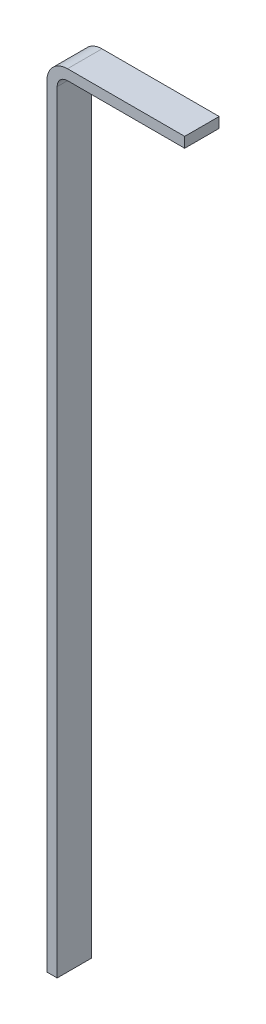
from build123d import *

# Parameters (mm, degrees)
BOSS_EXTRU_1_DEPTH = 20


with BuildPart() as part:
    # Esquisse1 → Boss.-Extru.1 (new body)
    with BuildSketch(Plane.XY):
        with BuildLine():
            Line((68, 12), (0, 12))
            ThreePointArc((0, 12), (-8.485281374, 8.485281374), (-12, 0))
            Line((-12, 0), (-12, -448))
            Line((-12, -448), (-6, -448))
            Line((-6, -448), (-6, 0))
            ThreePointArc((-6, 0), (-4.242640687, 4.242640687), (0, 6))
            Line((0, 6), (68, 6))
            Line((68, 6), (68, 12))
        make_face()
    extrude(amount=BOSS_EXTRU_1_DEPTH)


solid = part.part
